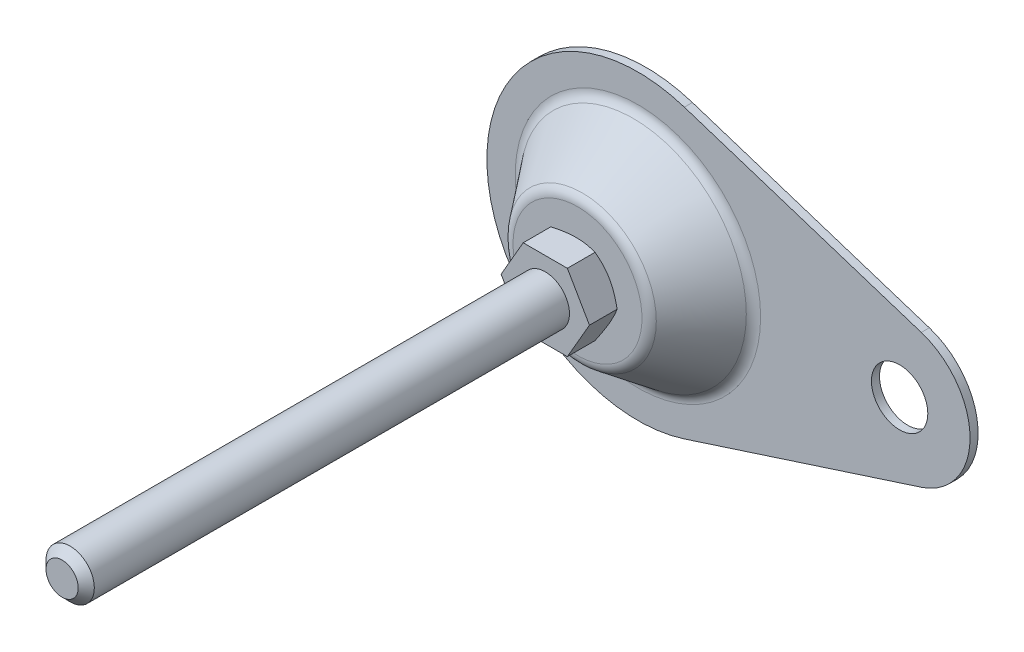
ISO-10303-21;
HEADER;
FILE_DESCRIPTION(('STEP AP214'),'2;1');
FILE_NAME('part.step','',(''),(''),'','','');
FILE_SCHEMA(('AUTOMOTIVE_DESIGN { 1 0 10303 214 1 1 1 1 }'));
ENDSEC;
DATA;
#1=APPLICATION_CONTEXT('core data for automotive mechanical design processes');
#2=APPLICATION_PROTOCOL_DEFINITION('international standard','automotive_design',2000,#1);
#3=PRODUCT_CONTEXT('',#1,'mechanical');
#4=PRODUCT('Part','Part','',(#3));
#5=PRODUCT_RELATED_PRODUCT_CATEGORY('part','',(#4));
#6=PRODUCT_DEFINITION_FORMATION('','',#4);
#7=PRODUCT_DEFINITION_CONTEXT('part definition',#1,'design');
#8=PRODUCT_DEFINITION('design','',#6,#7);
#9=PRODUCT_DEFINITION_SHAPE('','',#8);
#10=(LENGTH_UNIT() NAMED_UNIT(*) SI_UNIT(.MILLI.,.METRE.));
#11=(NAMED_UNIT(*) PLANE_ANGLE_UNIT() SI_UNIT($,.RADIAN.));
#12=(NAMED_UNIT(*) SI_UNIT($,.STERADIAN.) SOLID_ANGLE_UNIT());
#13=UNCERTAINTY_MEASURE_WITH_UNIT(LENGTH_MEASURE(1.E-05),#10,'distance_accuracy_value','');
#14=(GEOMETRIC_REPRESENTATION_CONTEXT(3) GLOBAL_UNCERTAINTY_ASSIGNED_CONTEXT((#13)) GLOBAL_UNIT_ASSIGNED_CONTEXT((#10,
#11,#12)) REPRESENTATION_CONTEXT('',''));
#15=CARTESIAN_POINT('',(0.,0.,0.));
#16=DIRECTION('',(0.,0.,1.));
#17=DIRECTION('',(1.,0.,0.));
#18=AXIS2_PLACEMENT_3D('',#15,#16,#17);
#19=CARTESIAN_POINT('',(65.,0.,2.));
#20=DIRECTION('',(0.,0.,1.));
#21=DIRECTION('',(1.,0.,0.));
#22=AXIS2_PLACEMENT_3D('',#19,#20,#21);
#23=PLANE('',#22);
#24=CARTESIAN_POINT('',(0.,0.,2.));
#25=DIRECTION('',(0.,0.,1.));
#26=DIRECTION('',(1.,0.,0.));
#27=AXIS2_PLACEMENT_3D('',#24,#25,#26);
#28=CIRCLE('',#27,30.4802116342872);
#29=CARTESIAN_POINT('',(30.4802116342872,0.,2.));
#30=VERTEX_POINT('',#29);
#31=EDGE_CURVE('E245',#30,#30,#28,.F.);
#32=ORIENTED_EDGE('',*,*,#31,.T.);
#33=EDGE_LOOP('',(#32));
#34=FACE_BOUND('',#33,.T.);
#35=CARTESIAN_POINT('',(65.,0.,2.));
#36=DIRECTION('',(0.,0.,1.));
#37=DIRECTION('',(1.,0.,0.));
#38=AXIS2_PLACEMENT_3D('',#35,#36,#37);
#39=CIRCLE('',#38,7.);
#40=CARTESIAN_POINT('',(72.,0.,2.));
#41=VERTEX_POINT('',#40);
#42=EDGE_CURVE('E262',#41,#41,#39,.T.);
#43=ORIENTED_EDGE('',*,*,#42,.F.);
#44=EDGE_LOOP('',(#43));
#45=FACE_BOUND('',#44,.T.);
#46=DIRECTION('',(-0.951485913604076,0.307692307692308,0.));
#47=VECTOR('',#46,1.);
#48=CARTESIAN_POINT('',(11.5384615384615,35.6807217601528,2.));
#49=LINE('',#48,#47);
#50=CARTESIAN_POINT('',(70.3846153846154,16.6510034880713,2.));
#51=VERTEX_POINT('',#50);
#52=CARTESIAN_POINT('',(11.5384615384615,35.6807217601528,2.));
#53=VERTEX_POINT('',#52);
#54=EDGE_CURVE('E112',#51,#53,#49,.T.);
#55=ORIENTED_EDGE('',*,*,#54,.T.);
#56=CARTESIAN_POINT('',(0.,0.,2.));
#57=DIRECTION('',(0.,0.,1.));
#58=DIRECTION('',(1.,0.,0.));
#59=AXIS2_PLACEMENT_3D('',#56,#57,#58);
#60=CIRCLE('',#59,37.5);
#61=CARTESIAN_POINT('',(11.5384615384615,-35.6807217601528,2.));
#62=VERTEX_POINT('',#61);
#63=EDGE_CURVE('E114',#53,#62,#60,.T.);
#64=ORIENTED_EDGE('',*,*,#63,.T.);
#65=DIRECTION('',(0.951485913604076,0.307692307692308,0.));
#66=VECTOR('',#65,1.);
#67=CARTESIAN_POINT('',(11.5384615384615,-35.6807217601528,2.));
#68=LINE('',#67,#66);
#69=CARTESIAN_POINT('',(70.3846153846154,-16.6510034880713,2.));
#70=VERTEX_POINT('',#69);
#71=EDGE_CURVE('E97',#62,#70,#68,.T.);
#72=ORIENTED_EDGE('',*,*,#71,.T.);
#73=CARTESIAN_POINT('',(65.,0.,2.));
#74=DIRECTION('',(0.,0.,1.));
#75=DIRECTION('',(1.,0.,0.));
#76=AXIS2_PLACEMENT_3D('',#73,#74,#75);
#77=CIRCLE('',#76,17.5);
#78=EDGE_CURVE('E106',#70,#51,#77,.T.);
#79=ORIENTED_EDGE('',*,*,#78,.T.);
#80=EDGE_LOOP('',(#55,#64,#72,#79));
#81=FACE_BOUND('',#80,.T.);
#82=ADVANCED_FACE('F14',(#34,#45,#81),#23,.T.);
#83=CARTESIAN_POINT('',(65.,0.,0.));
#84=DIRECTION('',(0.,0.,1.));
#85=DIRECTION('',(1.,0.,0.));
#86=AXIS2_PLACEMENT_3D('',#83,#84,#85);
#87=PLANE('',#86);
#88=CARTESIAN_POINT('',(65.,0.,0.));
#89=DIRECTION('',(0.,0.,1.));
#90=DIRECTION('',(1.,0.,0.));
#91=AXIS2_PLACEMENT_3D('',#88,#89,#90);
#92=CIRCLE('',#91,7.);
#93=CARTESIAN_POINT('',(72.,0.,0.));
#94=VERTEX_POINT('',#93);
#95=EDGE_CURVE('E258',#94,#94,#92,.T.);
#96=ORIENTED_EDGE('',*,*,#95,.T.);
#97=EDGE_LOOP('',(#96));
#98=FACE_BOUND('',#97,.T.);
#99=CARTESIAN_POINT('',(0.,0.,0.));
#100=DIRECTION('',(0.,0.,1.));
#101=DIRECTION('',(1.,0.,0.));
#102=AXIS2_PLACEMENT_3D('',#99,#100,#101);
#103=CIRCLE('',#102,37.5);
#104=CARTESIAN_POINT('',(11.5384615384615,35.6807217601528,0.));
#105=VERTEX_POINT('',#104);
#106=CARTESIAN_POINT('',(11.5384615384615,-35.6807217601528,0.));
#107=VERTEX_POINT('',#106);
#108=EDGE_CURVE('E275',#105,#107,#103,.T.);
#109=ORIENTED_EDGE('',*,*,#108,.F.);
#110=DIRECTION('',(-0.951485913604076,0.307692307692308,0.));
#111=VECTOR('',#110,1.);
#112=CARTESIAN_POINT('',(70.3846153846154,16.6510034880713,0.));
#113=LINE('',#112,#111);
#114=CARTESIAN_POINT('',(70.3846153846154,16.6510034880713,0.));
#115=VERTEX_POINT('',#114);
#116=EDGE_CURVE('E9',#115,#105,#113,.T.);
#117=ORIENTED_EDGE('',*,*,#116,.F.);
#118=CARTESIAN_POINT('',(65.,0.,0.));
#119=DIRECTION('',(0.,0.,1.));
#120=DIRECTION('',(1.,0.,0.));
#121=AXIS2_PLACEMENT_3D('',#118,#119,#120);
#122=CIRCLE('',#121,17.5);
#123=CARTESIAN_POINT('',(70.3846153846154,-16.6510034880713,0.));
#124=VERTEX_POINT('',#123);
#125=EDGE_CURVE('E22',#124,#115,#122,.T.);
#126=ORIENTED_EDGE('',*,*,#125,.F.);
#127=DIRECTION('',(0.951485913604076,0.307692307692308,0.));
#128=VECTOR('',#127,1.);
#129=CARTESIAN_POINT('',(70.3846153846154,-16.6510034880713,0.));
#130=LINE('',#129,#128);
#131=EDGE_CURVE('E99',#107,#124,#130,.T.);
#132=ORIENTED_EDGE('',*,*,#131,.F.);
#133=EDGE_LOOP('',(#109,#117,#126,#132));
#134=FACE_BOUND('',#133,.T.);
#135=ADVANCED_FACE('F215',(#98,#134),#87,.F.);
#136=CARTESIAN_POINT('',(0.,0.,17.));
#137=DIRECTION('',(0.,0.,-1.));
#138=DIRECTION('',(-1.,0.,0.));
#139=AXIS2_PLACEMENT_3D('',#136,#137,#138);
#140=PLANE('',#139);
#141=CARTESIAN_POINT('',(0.,0.,17.));
#142=DIRECTION('',(0.,0.,-1.));
#143=DIRECTION('',(-1.,0.,0.));
#144=AXIS2_PLACEMENT_3D('',#141,#142,#143);
#145=CIRCLE('',#144,16.0197883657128);
#146=CARTESIAN_POINT('',(-16.0197883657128,0.,17.));
#147=VERTEX_POINT('',#146);
#148=EDGE_CURVE('E278',#147,#147,#145,.F.);
#149=ORIENTED_EDGE('',*,*,#148,.T.);
#150=EDGE_LOOP('',(#149));
#151=FACE_BOUND('',#150,.T.);
#152=CARTESIAN_POINT('',(0.,0.,17.));
#153=DIRECTION('',(0.,0.,-1.));
#154=DIRECTION('',(-1.,0.,0.));
#155=AXIS2_PLACEMENT_3D('',#152,#153,#154);
#156=CIRCLE('',#155,9.);
#157=CARTESIAN_POINT('',(-9.,0.,17.));
#158=VERTEX_POINT('',#157);
#159=EDGE_CURVE('E122',#158,#158,#156,.T.);
#160=ORIENTED_EDGE('',*,*,#159,.T.);
#161=EDGE_LOOP('',(#160));
#162=FACE_BOUND('',#161,.T.);
#163=ADVANCED_FACE('F211',(#151,#162),#140,.F.);
#164=CARTESIAN_POINT('',(0.,0.,5.));
#165=DIRECTION('',(0.,0.,1.));
#166=DIRECTION('',(1.,0.,0.));
#167=AXIS2_PLACEMENT_3D('',#164,#165,#166);
#168=TOROIDAL_SURFACE('',#167,30.4802116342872,3.);
#169=CARTESIAN_POINT('',(0.,0.,3.1747053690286));
#170=DIRECTION('',(0.,0.,1.));
#171=DIRECTION('',(1.,0.,0.));
#172=AXIS2_PLACEMENT_3D('',#169,#170,#171);
#173=CIRCLE('',#172,28.0993925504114);
#174=CARTESIAN_POINT('',(28.0993925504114,0.,3.1747053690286));
#175=VERTEX_POINT('',#174);
#176=EDGE_CURVE('E242',#175,#175,#173,.T.);
#177=ORIENTED_EDGE('',*,*,#176,.F.);
#178=EDGE_LOOP('',(#177));
#179=FACE_BOUND('',#178,.T.);
#180=ORIENTED_EDGE('',*,*,#31,.F.);
#181=EDGE_LOOP('',(#180));
#182=FACE_BOUND('',#181,.T.);
#183=ADVANCED_FACE('F214',(#179,#182),#168,.F.);
#184=CARTESIAN_POINT('',(0.,0.,14.));
#185=DIRECTION('',(0.,0.,-1.));
#186=DIRECTION('',(-1.,0.,0.));
#187=AXIS2_PLACEMENT_3D('',#184,#185,#186);
#188=TOROIDAL_SURFACE('',#187,16.0197883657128,3.);
#189=ORIENTED_EDGE('',*,*,#148,.F.);
#190=EDGE_LOOP('',(#189));
#191=FACE_BOUND('',#190,.T.);
#192=CARTESIAN_POINT('',(0.,0.,15.8252946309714));
#193=DIRECTION('',(0.,0.,1.));
#194=DIRECTION('',(1.,0.,0.));
#195=AXIS2_PLACEMENT_3D('',#192,#193,#194);
#196=CIRCLE('',#195,18.4006074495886);
#197=CARTESIAN_POINT('',(18.4006074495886,0.,15.8252946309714));
#198=VERTEX_POINT('',#197);
#199=EDGE_CURVE('E251',#198,#198,#196,.F.);
#200=ORIENTED_EDGE('',*,*,#199,.F.);
#201=EDGE_LOOP('',(#200));
#202=FACE_BOUND('',#201,.T.);
#203=ADVANCED_FACE('F229',(#191,#202),#188,.T.);
#204=CARTESIAN_POINT('',(0.,0.,2.));
#205=DIRECTION('',(0.,0.,-1.));
#206=DIRECTION('',(-1.,0.,0.));
#207=AXIS2_PLACEMENT_3D('',#204,#205,#206);
#208=CYLINDRICAL_SURFACE('',#207,37.5);
#209=ORIENTED_EDGE('',*,*,#108,.T.);
#210=DIRECTION('',(0.,0.,1.));
#211=VECTOR('',#210,1.);
#212=CARTESIAN_POINT('',(11.5384615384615,-35.6807217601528,-8.));
#213=LINE('',#212,#211);
#214=EDGE_CURVE('E103',#107,#62,#213,.T.);
#215=ORIENTED_EDGE('',*,*,#214,.T.);
#216=ORIENTED_EDGE('',*,*,#63,.F.);
#217=DIRECTION('',(0.,0.,1.));
#218=VECTOR('',#217,1.);
#219=CARTESIAN_POINT('',(11.5384615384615,35.6807217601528,-8.));
#220=LINE('',#219,#218);
#221=EDGE_CURVE('E119',#105,#53,#220,.T.);
#222=ORIENTED_EDGE('',*,*,#221,.F.);
#223=EDGE_LOOP('',(#209,#215,#216,#222));
#224=FACE_BOUND('',#223,.T.);
#225=ADVANCED_FACE('F219',(#224),#208,.T.);
#226=CARTESIAN_POINT('',(65.,0.,2.));
#227=DIRECTION('',(0.,0.,-1.));
#228=DIRECTION('',(-1.,0.,0.));
#229=AXIS2_PLACEMENT_3D('',#226,#227,#228);
#230=CYLINDRICAL_SURFACE('',#229,7.);
#231=ORIENTED_EDGE('',*,*,#42,.T.);
#232=EDGE_LOOP('',(#231));
#233=FACE_BOUND('',#232,.T.);
#234=ORIENTED_EDGE('',*,*,#95,.F.);
#235=EDGE_LOOP('',(#234));
#236=FACE_BOUND('',#235,.T.);
#237=ADVANCED_FACE('F209',(#233,#236),#230,.F.);
#238=CARTESIAN_POINT('',(0.,0.,2.));
#239=DIRECTION('',(0.,0.,-1.));
#240=DIRECTION('',(-1.,0.,0.));
#241=AXIS2_PLACEMENT_3D('',#238,#239,#240);
#242=CONICAL_SURFACE('',#241,29.,0.654082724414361);
#243=ORIENTED_EDGE('',*,*,#176,.T.);
#244=EDGE_LOOP('',(#243));
#245=FACE_BOUND('',#244,.T.);
#246=ORIENTED_EDGE('',*,*,#199,.T.);
#247=EDGE_LOOP('',(#246));
#248=FACE_BOUND('',#247,.T.);
#249=ADVANCED_FACE('F151',(#245,#248),#242,.T.);
#250=CARTESIAN_POINT('',(0.,0.,17.));
#251=DIRECTION('',(0.,0.,1.));
#252=DIRECTION('',(1.,0.,0.));
#253=AXIS2_PLACEMENT_3D('',#250,#251,#252);
#254=CONICAL_SURFACE('',#253,9.,1.0471975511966);
#255=ORIENTED_EDGE('',*,*,#159,.F.);
#256=EDGE_LOOP('',(#255));
#257=FACE_BOUND('',#256,.T.);
#258=CARTESIAN_POINT('',(10.9697705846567,0.0002,18.137247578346));
#259=CARTESIAN_POINT('',(10.8492020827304,-0.208630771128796,18.0676485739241));
#260=CARTESIAN_POINT('',(10.7281840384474,-0.418240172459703,18.0012084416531));
#261=CARTESIAN_POINT('',(10.4851774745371,-0.839139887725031,17.8755224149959));
#262=CARTESIAN_POINT('',(10.3631886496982,-1.05043073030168,17.8162788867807));
#263=CARTESIAN_POINT('',(9.99525656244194,-1.68770779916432,17.6504897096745));
#264=CARTESIAN_POINT('',(9.74786083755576,-2.11620976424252,17.5561895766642));
#265=CARTESIAN_POINT('',(9.37764446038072,-2.75744333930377,17.4456138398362));
#266=CARTESIAN_POINT('',(9.2559298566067,-2.96825921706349,17.4141149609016));
#267=CARTESIAN_POINT('',(9.01193711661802,-3.39086703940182,17.3612933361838));
#268=CARTESIAN_POINT('',(8.88965896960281,-3.60265900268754,17.3399707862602));
#269=CARTESIAN_POINT('',(8.64489870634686,-4.02659621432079,17.3080481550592));
#270=CARTESIAN_POINT('',(8.52241700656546,-4.23874074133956,17.2974353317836));
#271=CARTESIAN_POINT('',(8.27734047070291,-4.66322575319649,17.2871576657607));
#272=CARTESIAN_POINT('',(8.15474563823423,-4.87556623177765,17.2874924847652));
#273=CARTESIAN_POINT('',(7.92555157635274,-5.27254199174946,17.2983485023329));
#274=CARTESIAN_POINT('',(7.81893617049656,-5.45720529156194,17.3075454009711));
#275=CARTESIAN_POINT('',(7.60595470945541,-5.82610000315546,17.3340405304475));
#276=CARTESIAN_POINT('',(7.49958867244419,-6.01033138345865,17.3513393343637));
#277=CARTESIAN_POINT('',(7.18090270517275,-6.56231167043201,17.414979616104));
#278=CARTESIAN_POINT('',(6.96914687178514,-6.92908353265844,17.4730570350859));
#279=CARTESIAN_POINT('',(6.5433889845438,-7.66651782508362,17.6182511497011));
#280=CARTESIAN_POINT('',(6.32944126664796,-8.03708614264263,17.7059833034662));
#281=CARTESIAN_POINT('',(5.90473630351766,-8.77269671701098,17.9050988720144));
#282=CARTESIAN_POINT('',(5.69397361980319,-9.137748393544,18.0164355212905));
#283=CARTESIAN_POINT('',(5.48471208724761,-9.5002,18.137247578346));
#284=B_SPLINE_CURVE_WITH_KNOTS('',3,(#258,#259,#260,#261,#262,#263,#264,#265,#266,#267,#268,
#269,#270,#271,#272,#273,#274,#275,#276,#277,#278,#279,#280,#281,#282,#283),.UNSPECIFIED.,.F.,
.F.,(4,2,2,2,2,2,2,2,2,2,2,2,4),(0.,0.752880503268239,1.50600787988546,3.01546870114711,
3.75167336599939,4.48789219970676,5.22323407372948,5.95855322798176,6.59868084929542,
7.23885375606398,8.52010929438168,9.82978009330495,11.1368800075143),.UNSPECIFIED.);
#285=CARTESIAN_POINT('',(10.9696551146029,0.,18.1371809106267));
#286=VERTEX_POINT('',#285);
#287=CARTESIAN_POINT('',(5.48482755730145,-9.5,18.1371809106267));
#288=VERTEX_POINT('',#287);
#289=EDGE_CURVE('E29',#286,#288,#284,.T.);
#290=ORIENTED_EDGE('',*,*,#289,.T.);
#291=CARTESIAN_POINT('',(-14.8064925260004,-9.5,21.9606551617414));
#292=CARTESIAN_POINT('',(-14.5986882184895,-9.5,21.8596787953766));
#293=CARTESIAN_POINT('',(-14.3906419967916,-9.5,21.759200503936));
#294=CARTESIAN_POINT('',(-13.9740152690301,-9.5,21.5593527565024));
#295=CARTESIAN_POINT('',(-13.7654347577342,-9.5,21.4599833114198));
#296=CARTESIAN_POINT('',(-13.1387615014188,-9.5,21.1636815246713));
#297=CARTESIAN_POINT('',(-12.7197974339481,-9.5,20.9685851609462));
#298=CARTESIAN_POINT('',(-11.876845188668,-9.5,20.5834203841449));
#299=CARTESIAN_POINT('',(-11.4528421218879,-9.5,20.3933844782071));
#300=CARTESIAN_POINT('',(-10.6014891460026,-9.5,20.0209911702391));
#301=CARTESIAN_POINT('',(-10.1741393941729,-9.5,19.8386334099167));
#302=CARTESIAN_POINT('',(-9.30148954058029,-9.5,19.4778705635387));
#303=CARTESIAN_POINT('',(-8.85605656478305,-9.5,19.2997851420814));
#304=CARTESIAN_POINT('',(-7.96000820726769,-9.5,18.9569149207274));
#305=CARTESIAN_POINT('',(-7.50939225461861,-9.5,18.7921316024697));
#306=CARTESIAN_POINT('',(-6.60307461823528,-9.5,18.4801372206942));
#307=CARTESIAN_POINT('',(-6.14738507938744,-9.5,18.3328912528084));
#308=CARTESIAN_POINT('',(-5.2294867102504,-9.5,18.0606451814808));
#309=CARTESIAN_POINT('',(-4.76727995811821,-9.5,17.9356381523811));
#310=CARTESIAN_POINT('',(-3.83850935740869,-9.5,17.714476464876));
#311=CARTESIAN_POINT('',(-3.37198330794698,-9.5,17.618167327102));
#312=CARTESIAN_POINT('',(-2.66788845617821,-9.5,17.4993766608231));
#313=CARTESIAN_POINT('',(-2.43245627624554,-9.5,17.4640570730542));
#314=CARTESIAN_POINT('',(-1.96039683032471,-9.5,17.4026664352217));
#315=CARTESIAN_POINT('',(-1.72376968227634,-9.5,17.3765944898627));
#316=CARTESIAN_POINT('',(-1.25276277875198,-9.5,17.3345496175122));
#317=CARTESIAN_POINT('',(-1.01839455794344,-9.5,17.3184479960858));
#318=CARTESIAN_POINT('',(-0.549187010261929,-9.5,17.2961739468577));
#319=CARTESIAN_POINT('',(-0.314347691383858,-9.5,17.2900013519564));
#320=CARTESIAN_POINT('',(0.155383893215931,-9.5,17.2877328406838));
#321=CARTESIAN_POINT('',(0.390276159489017,-9.5,17.2916370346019));
#322=CARTESIAN_POINT('',(0.859685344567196,-9.5,17.3094258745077));
#323=CARTESIAN_POINT('',(1.09420224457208,-9.5,17.3233110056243));
#324=CARTESIAN_POINT('',(1.65546939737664,-9.5,17.3681902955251));
#325=CARTESIAN_POINT('',(1.98185940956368,-9.5,17.403789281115));
#326=CARTESIAN_POINT('',(2.63225087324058,-9.5,17.4923957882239));
#327=CARTESIAN_POINT('',(2.95625200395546,-9.5,17.5454056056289));
#328=CARTESIAN_POINT('',(3.92427118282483,-9.5,17.7277430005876));
#329=CARTESIAN_POINT('',(4.56396460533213,-9.5,17.8803476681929));
#330=CARTESIAN_POINT('',(5.52083770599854,-9.5,18.1454776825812));
#331=CARTESIAN_POINT('',(5.84296313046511,-9.5,18.2411831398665));
#332=CARTESIAN_POINT('',(6.48408498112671,-9.5,18.4426495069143));
#333=CARTESIAN_POINT('',(6.803081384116,-9.5,18.5484104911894));
#334=CARTESIAN_POINT('',(7.43804722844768,-9.5,18.7682810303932));
#335=CARTESIAN_POINT('',(7.75401757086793,-9.5,18.8823880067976));
#336=CARTESIAN_POINT('',(8.3833286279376,-9.5,19.11759608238));
#337=CARTESIAN_POINT('',(8.69666939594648,-9.5,19.2386970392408));
#338=CARTESIAN_POINT('',(9.5211598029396,-9.5,19.5662339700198));
#339=CARTESIAN_POINT('',(10.0303459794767,-9.5,19.7776070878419));
#340=CARTESIAN_POINT('',(11.0436826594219,-9.5,20.2121380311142));
#341=CARTESIAN_POINT('',(11.5478326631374,-9.5,20.4352970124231));
#342=CARTESIAN_POINT('',(12.552217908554,-9.5,20.8906790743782));
#343=CARTESIAN_POINT('',(13.0524517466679,-9.5,21.1229052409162));
#344=CARTESIAN_POINT('',(14.0496005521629,-9.5,21.5943096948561));
#345=CARTESIAN_POINT('',(14.5465156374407,-9.5,21.8334877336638));
#346=CARTESIAN_POINT('',(15.5384000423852,-9.5,22.3176747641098));
#347=CARTESIAN_POINT('',(16.0333654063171,-9.5,22.5626918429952));
#348=CARTESIAN_POINT('',(17.0211046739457,-9.5,23.0571059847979));
#349=CARTESIAN_POINT('',(17.5138785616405,-9.5,23.3065030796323));
#350=CARTESIAN_POINT('',(18.497520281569,-9.5,23.8087855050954));
#351=CARTESIAN_POINT('',(18.9883884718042,-9.5,24.0616701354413));
#352=CARTESIAN_POINT('',(19.9686217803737,-9.5,24.5703375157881));
#353=CARTESIAN_POINT('',(20.4579868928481,-9.5,24.8261202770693));
#354=CARTESIAN_POINT('',(21.8249398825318,-9.5,25.5448554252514));
#355=CARTESIAN_POINT('',(22.7011299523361,-9.5,26.0104658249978));
#356=CARTESIAN_POINT('',(24.4505547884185,-9.5,26.9473081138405));
#357=CARTESIAN_POINT('',(25.3237893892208,-9.5,27.4185403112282));
#358=CARTESIAN_POINT('',(27.0652521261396,-9.5,28.3637393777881));
#359=CARTESIAN_POINT('',(27.9334873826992,-9.5,28.8376931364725));
#360=CARTESIAN_POINT('',(29.2344830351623,-9.5,29.5510225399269));
#361=CARTESIAN_POINT('',(29.6679066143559,-9.5,29.7891902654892));
#362=CARTESIAN_POINT('',(30.5343584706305,-9.5,30.2662424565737));
#363=CARTESIAN_POINT('',(30.967386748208,-9.5,30.5051269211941));
#364=CARTESIAN_POINT('',(31.4002412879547,-9.5,30.7443258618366));
#365=B_SPLINE_CURVE_WITH_KNOTS('',3,(#291,#292,#293,#294,#295,#296,#297,#298,#299,#300,#301,
#302,#303,#304,#305,#306,#307,#308,#309,#310,#311,#312,#313,#314,#315,#316,#317,#318,#319,#320,
#321,#322,#323,#324,#325,#326,#327,#328,#329,#330,#331,#332,#333,#334,#335,#336,#337,#338,#339,
#340,#341,#342,#343,#344,#345,#346,#347,#348,#349,#350,#351,#352,#353,#354,#355,#356,#357,#358,
#359,#360,#361,#362,#363,#364),.UNSPECIFIED.,.F.,.F.,(4,2,2,2,2,2,2,2,2,2,2,2,2,2,2,2,2,2,2,2,2,
2,2,2,2,2,2,2,2,2,2,2,2,2,2,2,4),(0.,0.693114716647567,1.38623624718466,2.77268086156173,
4.16654752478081,5.56034907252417,6.99932446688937,8.43845991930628,9.87468144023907,
11.310454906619,12.7383539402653,13.4524012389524,14.166379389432,14.8709383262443,
15.5754854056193,16.2800401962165,16.9846292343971,17.9690518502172,18.95360432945,
20.9237300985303,21.9317704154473,22.9398182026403,23.9475558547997,24.9552730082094,
26.6090019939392,28.2628934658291,29.9173528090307,31.5717530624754,33.2285958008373,
34.8854506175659,36.5419774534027,38.1985107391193,41.1751413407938,44.1519359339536,
47.119447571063,48.6030975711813,50.0867457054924),.UNSPECIFIED.);
#366=CARTESIAN_POINT('',(-5.48482755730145,-9.5,18.1371809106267));
#367=VERTEX_POINT('',#366);
#368=EDGE_CURVE('E158',#288,#367,#365,.F.);
#369=ORIENTED_EDGE('',*,*,#368,.T.);
#370=CARTESIAN_POINT('',(-5.48471208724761,-9.5002,18.137247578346));
#371=CARTESIAN_POINT('',(-5.6052805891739,-9.29136922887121,18.0676485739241));
#372=CARTESIAN_POINT('',(-5.72629863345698,-9.0817598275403,18.0012084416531));
#373=CARTESIAN_POINT('',(-5.96930519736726,-8.66086011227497,17.8755224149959));
#374=CARTESIAN_POINT('',(-6.09129402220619,-8.44956926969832,17.8162788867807));
#375=CARTESIAN_POINT('',(-6.4592261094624,-7.81229220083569,17.6504897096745));
#376=CARTESIAN_POINT('',(-6.70662183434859,-7.38379023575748,17.5561895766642));
#377=CARTESIAN_POINT('',(-7.07683821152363,-6.74255666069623,17.4456138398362));
#378=CARTESIAN_POINT('',(-7.19855281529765,-6.53174078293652,17.4141149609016));
#379=CARTESIAN_POINT('',(-7.44254555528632,-6.10913296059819,17.3612933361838));
#380=CARTESIAN_POINT('',(-7.56482370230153,-5.89734099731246,17.3399707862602));
#381=CARTESIAN_POINT('',(-7.80958396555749,-5.47340378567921,17.3080481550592));
#382=CARTESIAN_POINT('',(-7.93206566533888,-5.26125925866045,17.2974353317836));
#383=CARTESIAN_POINT('',(-8.17714220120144,-4.83677424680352,17.2871576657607));
#384=CARTESIAN_POINT('',(-8.29973703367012,-4.62443376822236,17.2874924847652));
#385=CARTESIAN_POINT('',(-8.52893109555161,-4.22745800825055,17.2983485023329));
#386=CARTESIAN_POINT('',(-8.63554650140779,-4.04279470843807,17.3075454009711));
#387=CARTESIAN_POINT('',(-8.84852796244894,-3.67389999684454,17.3340405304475));
#388=CARTESIAN_POINT('',(-8.95489399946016,-3.48966861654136,17.3513393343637));
#389=CARTESIAN_POINT('',(-9.27357996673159,-2.937688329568,17.414979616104));
#390=CARTESIAN_POINT('',(-9.48533580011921,-2.57091646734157,17.473057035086));
#391=CARTESIAN_POINT('',(-9.91109368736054,-1.83348217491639,17.6182511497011));
#392=CARTESIAN_POINT('',(-10.1250414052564,-1.46291385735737,17.7059833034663));
#393=CARTESIAN_POINT('',(-10.5497463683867,-0.727303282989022,17.9050988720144));
#394=CARTESIAN_POINT('',(-10.7605090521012,-0.362251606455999,18.0164355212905));
#395=CARTESIAN_POINT('',(-10.9697705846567,0.000199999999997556,18.137247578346));
#396=B_SPLINE_CURVE_WITH_KNOTS('',3,(#370,#371,#372,#373,#374,#375,#376,#377,#378,#379,#380,
#381,#382,#383,#384,#385,#386,#387,#388,#389,#390,#391,#392,#393,#394,#395),.UNSPECIFIED.,.F.,
.F.,(4,2,2,2,2,2,2,2,2,2,2,2,4),(0.,0.752880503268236,1.50600787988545,3.0154687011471,
3.75167336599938,4.48789219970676,5.22323407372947,5.95855322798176,6.59868084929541,
7.23885375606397,8.52010929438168,9.82978009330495,11.1368800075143),.UNSPECIFIED.);
#397=CARTESIAN_POINT('',(-10.9696551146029,0.,18.1371809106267));
#398=VERTEX_POINT('',#397);
#399=EDGE_CURVE('E127',#367,#398,#396,.T.);
#400=ORIENTED_EDGE('',*,*,#399,.T.);
#401=CARTESIAN_POINT('',(-10.9697705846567,-0.000200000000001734,18.137247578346));
#402=CARTESIAN_POINT('',(-10.8492020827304,0.208630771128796,18.0676485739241));
#403=CARTESIAN_POINT('',(-10.7281840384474,0.418240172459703,18.0012084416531));
#404=CARTESIAN_POINT('',(-10.4851774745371,0.83913988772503,17.8755224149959));
#405=CARTESIAN_POINT('',(-10.3631886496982,1.05043073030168,17.8162788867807));
#406=CARTESIAN_POINT('',(-9.99525656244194,1.68770779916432,17.6504897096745));
#407=CARTESIAN_POINT('',(-9.74786083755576,2.11620976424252,17.5561895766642));
#408=CARTESIAN_POINT('',(-9.37764446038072,2.75744333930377,17.4456138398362));
#409=CARTESIAN_POINT('',(-9.2559298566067,2.96825921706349,17.4141149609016));
#410=CARTESIAN_POINT('',(-9.01193711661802,3.39086703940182,17.3612933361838));
#411=CARTESIAN_POINT('',(-8.88965896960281,3.60265900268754,17.3399707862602));
#412=CARTESIAN_POINT('',(-8.64489870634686,4.02659621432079,17.3080481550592));
#413=CARTESIAN_POINT('',(-8.52241700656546,4.23874074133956,17.2974353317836));
#414=CARTESIAN_POINT('',(-8.27734047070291,4.66322575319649,17.2871576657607));
#415=CARTESIAN_POINT('',(-8.15474563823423,4.87556623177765,17.2874924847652));
#416=CARTESIAN_POINT('',(-7.92555157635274,5.27254199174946,17.2983485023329));
#417=CARTESIAN_POINT('',(-7.81893617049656,5.45720529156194,17.3075454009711));
#418=CARTESIAN_POINT('',(-7.60595470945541,5.82610000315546,17.3340405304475));
#419=CARTESIAN_POINT('',(-7.49958867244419,6.01033138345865,17.3513393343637));
#420=CARTESIAN_POINT('',(-7.18090270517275,6.56231167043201,17.414979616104));
#421=CARTESIAN_POINT('',(-6.96914687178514,6.92908353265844,17.4730570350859));
#422=CARTESIAN_POINT('',(-6.5433889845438,7.66651782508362,17.6182511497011));
#423=CARTESIAN_POINT('',(-6.32944126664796,8.03708614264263,17.7059833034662));
#424=CARTESIAN_POINT('',(-5.90473630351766,8.77269671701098,17.9050988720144));
#425=CARTESIAN_POINT('',(-5.69397361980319,9.13774839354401,18.0164355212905));
#426=CARTESIAN_POINT('',(-5.48471208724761,9.5002,18.137247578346));
#427=B_SPLINE_CURVE_WITH_KNOTS('',3,(#401,#402,#403,#404,#405,#406,#407,#408,#409,#410,#411,
#412,#413,#414,#415,#416,#417,#418,#419,#420,#421,#422,#423,#424,#425,#426),.UNSPECIFIED.,.F.,
.F.,(4,2,2,2,2,2,2,2,2,2,2,2,4),(0.,0.752880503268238,1.50600787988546,3.01546870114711,
3.75167336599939,4.48789219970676,5.22323407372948,5.95855322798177,6.59868084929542,
7.23885375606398,8.52010929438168,9.82978009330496,11.1368800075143),.UNSPECIFIED.);
#428=CARTESIAN_POINT('',(-5.48482755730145,9.5,18.1371809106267));
#429=VERTEX_POINT('',#428);
#430=EDGE_CURVE('E135',#398,#429,#427,.T.);
#431=ORIENTED_EDGE('',*,*,#430,.T.);
#432=CARTESIAN_POINT('',(-14.8064925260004,9.5,21.9606551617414));
#433=CARTESIAN_POINT('',(-14.5986882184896,9.5,21.8596787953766));
#434=CARTESIAN_POINT('',(-14.3906419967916,9.5,21.759200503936));
#435=CARTESIAN_POINT('',(-13.9740152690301,9.5,21.5593527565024));
#436=CARTESIAN_POINT('',(-13.7654347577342,9.5,21.4599833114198));
#437=CARTESIAN_POINT('',(-13.1387615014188,9.5,21.1636815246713));
#438=CARTESIAN_POINT('',(-12.7197974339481,9.5,20.9685851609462));
#439=CARTESIAN_POINT('',(-11.876845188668,9.5,20.5834203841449));
#440=CARTESIAN_POINT('',(-11.4528421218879,9.5,20.3933844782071));
#441=CARTESIAN_POINT('',(-10.6014891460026,9.5,20.0209911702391));
#442=CARTESIAN_POINT('',(-10.1741393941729,9.5,19.8386334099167));
#443=CARTESIAN_POINT('',(-9.3014895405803,9.5,19.4778705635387));
#444=CARTESIAN_POINT('',(-8.85605656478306,9.5,19.2997851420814));
#445=CARTESIAN_POINT('',(-7.9600082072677,9.5,18.9569149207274));
#446=CARTESIAN_POINT('',(-7.50939225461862,9.5,18.7921316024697));
#447=CARTESIAN_POINT('',(-6.60307461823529,9.5,18.4801372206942));
#448=CARTESIAN_POINT('',(-6.14738507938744,9.5,18.3328912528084));
#449=CARTESIAN_POINT('',(-5.2294867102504,9.5,18.0606451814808));
#450=CARTESIAN_POINT('',(-4.76727995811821,9.5,17.9356381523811));
#451=CARTESIAN_POINT('',(-3.83850935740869,9.5,17.714476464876));
#452=CARTESIAN_POINT('',(-3.37198330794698,9.5,17.618167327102));
#453=CARTESIAN_POINT('',(-2.66788845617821,9.5,17.4993766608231));
#454=CARTESIAN_POINT('',(-2.43245627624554,9.5,17.4640570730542));
#455=CARTESIAN_POINT('',(-1.96039683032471,9.5,17.4026664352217));
#456=CARTESIAN_POINT('',(-1.72376968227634,9.5,17.3765944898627));
#457=CARTESIAN_POINT('',(-1.25276277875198,9.5,17.3345496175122));
#458=CARTESIAN_POINT('',(-1.01839455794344,9.5,17.3184479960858));
#459=CARTESIAN_POINT('',(-0.549187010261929,9.5,17.2961739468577));
#460=CARTESIAN_POINT('',(-0.314347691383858,9.5,17.2900013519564));
#461=CARTESIAN_POINT('',(0.155383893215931,9.5,17.2877328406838));
#462=CARTESIAN_POINT('',(0.390276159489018,9.5,17.2916370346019));
#463=CARTESIAN_POINT('',(0.859685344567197,9.5,17.3094258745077));
#464=CARTESIAN_POINT('',(1.09420224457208,9.5,17.3233110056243));
#465=CARTESIAN_POINT('',(1.65546939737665,9.5,17.3681902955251));
#466=CARTESIAN_POINT('',(1.98185940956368,9.5,17.403789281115));
#467=CARTESIAN_POINT('',(2.63225087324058,9.5,17.4923957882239));
#468=CARTESIAN_POINT('',(2.95625200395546,9.5,17.5454056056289));
#469=CARTESIAN_POINT('',(3.92427118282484,9.5,17.7277430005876));
#470=CARTESIAN_POINT('',(4.56396460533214,9.5,17.8803476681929));
#471=CARTESIAN_POINT('',(5.52083770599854,9.5,18.1454776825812));
#472=CARTESIAN_POINT('',(5.84296313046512,9.5,18.2411831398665));
#473=CARTESIAN_POINT('',(6.48408498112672,9.5,18.4426495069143));
#474=CARTESIAN_POINT('',(6.80308138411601,9.5,18.5484104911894));
#475=CARTESIAN_POINT('',(7.43804722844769,9.5,18.7682810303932));
#476=CARTESIAN_POINT('',(7.75401757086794,9.5,18.8823880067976));
#477=CARTESIAN_POINT('',(8.3833286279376,9.5,19.11759608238));
#478=CARTESIAN_POINT('',(8.69666939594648,9.5,19.2386970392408));
#479=CARTESIAN_POINT('',(9.52115980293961,9.5,19.5662339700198));
#480=CARTESIAN_POINT('',(10.0303459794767,9.5,19.7776070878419));
#481=CARTESIAN_POINT('',(11.0436826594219,9.5,20.2121380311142));
#482=CARTESIAN_POINT('',(11.5478326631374,9.5,20.4352970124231));
#483=CARTESIAN_POINT('',(12.552217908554,9.5,20.8906790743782));
#484=CARTESIAN_POINT('',(13.0524517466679,9.5,21.1229052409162));
#485=CARTESIAN_POINT('',(14.0496005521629,9.5,21.5943096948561));
#486=CARTESIAN_POINT('',(14.5465156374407,9.5,21.8334877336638));
#487=CARTESIAN_POINT('',(15.5384000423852,9.5,22.3176747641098));
#488=CARTESIAN_POINT('',(16.0333654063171,9.5,22.5626918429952));
#489=CARTESIAN_POINT('',(17.0211046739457,9.5,23.0571059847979));
#490=CARTESIAN_POINT('',(17.5138785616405,9.5,23.3065030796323));
#491=CARTESIAN_POINT('',(18.497520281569,9.5,23.8087855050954));
#492=CARTESIAN_POINT('',(18.9883884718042,9.5,24.0616701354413));
#493=CARTESIAN_POINT('',(19.9686217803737,9.5,24.5703375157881));
#494=CARTESIAN_POINT('',(20.4579868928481,9.5,24.8261202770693));
#495=CARTESIAN_POINT('',(21.8249398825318,9.5,25.5448554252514));
#496=CARTESIAN_POINT('',(22.7011299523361,9.5,26.0104658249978));
#497=CARTESIAN_POINT('',(24.4505547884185,9.5,26.9473081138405));
#498=CARTESIAN_POINT('',(25.3237893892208,9.5,27.4185403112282));
#499=CARTESIAN_POINT('',(27.0652521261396,9.5,28.3637393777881));
#500=CARTESIAN_POINT('',(27.9334873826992,9.5,28.8376931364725));
#501=CARTESIAN_POINT('',(29.2344830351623,9.5,29.5510225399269));
#502=CARTESIAN_POINT('',(29.6679066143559,9.5,29.7891902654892));
#503=CARTESIAN_POINT('',(30.5343584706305,9.5,30.2662424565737));
#504=CARTESIAN_POINT('',(30.967386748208,9.5,30.5051269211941));
#505=CARTESIAN_POINT('',(31.4002412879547,9.5,30.7443258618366));
#506=B_SPLINE_CURVE_WITH_KNOTS('',3,(#432,#433,#434,#435,#436,#437,#438,#439,#440,#441,#442,
#443,#444,#445,#446,#447,#448,#449,#450,#451,#452,#453,#454,#455,#456,#457,#458,#459,#460,#461,
#462,#463,#464,#465,#466,#467,#468,#469,#470,#471,#472,#473,#474,#475,#476,#477,#478,#479,#480,
#481,#482,#483,#484,#485,#486,#487,#488,#489,#490,#491,#492,#493,#494,#495,#496,#497,#498,#499,
#500,#501,#502,#503,#504,#505),.UNSPECIFIED.,.F.,.F.,(4,2,2,2,2,2,2,2,2,2,2,2,2,2,2,2,2,2,2,2,2,
2,2,2,2,2,2,2,2,2,2,2,2,2,2,2,4),(0.,0.693114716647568,1.38623624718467,2.77268086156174,
4.16654752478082,5.56034907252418,6.99932446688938,8.43845991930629,9.87468144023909,
11.3104549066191,12.7383539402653,13.4524012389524,14.166379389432,14.8709383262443,
15.5754854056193,16.2800401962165,16.9846292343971,17.9690518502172,18.95360432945,
20.9237300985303,21.9317704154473,22.9398182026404,23.9475558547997,24.9552730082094,
26.6090019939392,28.2628934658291,29.9173528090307,31.5717530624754,33.2285958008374,
34.8854506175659,36.5419774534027,38.1985107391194,41.1751413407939,44.1519359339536,
47.1194475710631,48.6030975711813,50.0867457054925),.UNSPECIFIED.);
#507=CARTESIAN_POINT('',(5.48482755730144,9.5,18.1371809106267));
#508=VERTEX_POINT('',#507);
#509=EDGE_CURVE('E169',#429,#508,#506,.T.);
#510=ORIENTED_EDGE('',*,*,#509,.T.);
#511=CARTESIAN_POINT('',(5.48471208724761,9.5002,18.137247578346));
#512=CARTESIAN_POINT('',(5.6052805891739,9.29136922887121,18.0676485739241));
#513=CARTESIAN_POINT('',(5.72629863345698,9.0817598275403,18.0012084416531));
#514=CARTESIAN_POINT('',(5.96930519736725,8.66086011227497,17.8755224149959));
#515=CARTESIAN_POINT('',(6.09129402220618,8.44956926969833,17.8162788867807));
#516=CARTESIAN_POINT('',(6.4592261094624,7.81229220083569,17.6504897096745));
#517=CARTESIAN_POINT('',(6.70662183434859,7.38379023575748,17.5561895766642));
#518=CARTESIAN_POINT('',(7.07683821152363,6.74255666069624,17.4456138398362));
#519=CARTESIAN_POINT('',(7.19855281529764,6.53174078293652,17.4141149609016));
#520=CARTESIAN_POINT('',(7.44254555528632,6.10913296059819,17.3612933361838));
#521=CARTESIAN_POINT('',(7.56482370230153,5.89734099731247,17.3399707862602));
#522=CARTESIAN_POINT('',(7.80958396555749,5.47340378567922,17.3080481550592));
#523=CARTESIAN_POINT('',(7.93206566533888,5.26125925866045,17.2974353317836));
#524=CARTESIAN_POINT('',(8.17714220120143,4.83677424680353,17.2871576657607));
#525=CARTESIAN_POINT('',(8.29973703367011,4.62443376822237,17.2874924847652));
#526=CARTESIAN_POINT('',(8.5289310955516,4.22745800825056,17.2983485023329));
#527=CARTESIAN_POINT('',(8.63554650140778,4.04279470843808,17.3075454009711));
#528=CARTESIAN_POINT('',(8.84852796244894,3.67389999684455,17.3340405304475));
#529=CARTESIAN_POINT('',(8.95489399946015,3.48966861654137,17.3513393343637));
#530=CARTESIAN_POINT('',(9.27357996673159,2.93768832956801,17.414979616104));
#531=CARTESIAN_POINT('',(9.4853358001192,2.57091646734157,17.473057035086));
#532=CARTESIAN_POINT('',(9.91109368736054,1.83348217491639,17.6182511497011));
#533=CARTESIAN_POINT('',(10.1250414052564,1.46291385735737,17.7059833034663));
#534=CARTESIAN_POINT('',(10.5497463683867,0.72730328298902,17.9050988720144));
#535=CARTESIAN_POINT('',(10.7605090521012,0.362251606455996,18.0164355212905));
#536=CARTESIAN_POINT('',(10.9697705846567,-0.000200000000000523,18.137247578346));
#537=B_SPLINE_CURVE_WITH_KNOTS('',3,(#511,#512,#513,#514,#515,#516,#517,#518,#519,#520,#521,
#522,#523,#524,#525,#526,#527,#528,#529,#530,#531,#532,#533,#534,#535,#536),.UNSPECIFIED.,.F.,
.F.,(4,2,2,2,2,2,2,2,2,2,2,2,4),(0.,0.752880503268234,1.50600787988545,3.0154687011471,
3.75167336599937,4.48789219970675,5.22323407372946,5.95855322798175,6.5986808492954,
7.23885375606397,8.52010929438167,9.82978009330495,11.1368800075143),.UNSPECIFIED.);
#538=EDGE_CURVE('E176',#508,#286,#537,.T.);
#539=ORIENTED_EDGE('',*,*,#538,.T.);
#540=EDGE_LOOP('',(#290,#369,#400,#431,#510,#539));
#541=FACE_BOUND('',#540,.T.);
#542=ADVANCED_FACE('F145',(#257,#541),#254,.T.);
#543=CARTESIAN_POINT('',(0.,0.,145.));
#544=DIRECTION('',(0.,0.,1.));
#545=DIRECTION('',(1.,0.,0.));
#546=AXIS2_PLACEMENT_3D('',#543,#544,#545);
#547=PLANE('',#546);
#548=CARTESIAN_POINT('',(0.,0.,145.));
#549=DIRECTION('',(0.,0.,1.));
#550=DIRECTION('',(1.,0.,0.));
#551=AXIS2_PLACEMENT_3D('',#548,#549,#550);
#552=CIRCLE('',#551,4.);
#553=CARTESIAN_POINT('',(4.,0.,145.));
#554=VERTEX_POINT('',#553);
#555=EDGE_CURVE('E246',#554,#554,#552,.T.);
#556=ORIENTED_EDGE('',*,*,#555,.T.);
#557=EDGE_LOOP('',(#556));
#558=FACE_BOUND('',#557,.T.);
#559=ADVANCED_FACE('F150',(#558),#547,.T.);
#560=CARTESIAN_POINT('',(0.,0.,145.));
#561=DIRECTION('',(0.,0.,-1.));
#562=DIRECTION('',(-1.,0.,0.));
#563=AXIS2_PLACEMENT_3D('',#560,#561,#562);
#564=CONICAL_SURFACE('',#563,4.,0.785398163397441);
#565=CARTESIAN_POINT('',(0.,0.,143.));
#566=DIRECTION('',(0.,0.,1.));
#567=DIRECTION('',(1.,0.,0.));
#568=AXIS2_PLACEMENT_3D('',#565,#566,#567);
#569=CIRCLE('',#568,6.);
#570=CARTESIAN_POINT('',(6.,0.,143.));
#571=VERTEX_POINT('',#570);
#572=EDGE_CURVE('E249',#571,#571,#569,.F.);
#573=ORIENTED_EDGE('',*,*,#572,.F.);
#574=EDGE_LOOP('',(#573));
#575=FACE_BOUND('',#574,.T.);
#576=ORIENTED_EDGE('',*,*,#555,.F.);
#577=EDGE_LOOP('',(#576));
#578=FACE_BOUND('',#577,.T.);
#579=ADVANCED_FACE('F16',(#575,#578),#564,.T.);
#580=CARTESIAN_POINT('',(0.,0.,145.));
#581=DIRECTION('',(0.,0.,-1.));
#582=DIRECTION('',(-1.,0.,0.));
#583=AXIS2_PLACEMENT_3D('',#580,#581,#582);
#584=CYLINDRICAL_SURFACE('',#583,6.);
#585=CARTESIAN_POINT('',(0.,0.,25.));
#586=DIRECTION('',(0.,0.,1.));
#587=DIRECTION('',(1.,0.,0.));
#588=AXIS2_PLACEMENT_3D('',#585,#586,#587);
#589=CIRCLE('',#588,6.);
#590=CARTESIAN_POINT('',(6.,0.,25.));
#591=VERTEX_POINT('',#590);
#592=EDGE_CURVE('E256',#591,#591,#589,.T.);
#593=ORIENTED_EDGE('',*,*,#592,.T.);
#594=EDGE_LOOP('',(#593));
#595=FACE_BOUND('',#594,.T.);
#596=ORIENTED_EDGE('',*,*,#572,.T.);
#597=EDGE_LOOP('',(#596));
#598=FACE_BOUND('',#597,.T.);
#599=ADVANCED_FACE('F203',(#595,#598),#584,.T.);
#600=CARTESIAN_POINT('',(0.,0.,25.));
#601=DIRECTION('',(0.,0.,1.));
#602=DIRECTION('',(1.,0.,0.));
#603=AXIS2_PLACEMENT_3D('',#600,#601,#602);
#604=PLANE('',#603);
#605=DIRECTION('',(0.5,0.866025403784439,0.));
#606=VECTOR('',#605,1.);
#607=CARTESIAN_POINT('',(5.48482755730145,-9.5,25.));
#608=LINE('',#607,#606);
#609=CARTESIAN_POINT('',(5.48482755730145,-9.5,25.));
#610=VERTEX_POINT('',#609);
#611=CARTESIAN_POINT('',(10.9696551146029,0.,25.));
#612=VERTEX_POINT('',#611);
#613=EDGE_CURVE('E321',#610,#612,#608,.T.);
#614=ORIENTED_EDGE('',*,*,#613,.T.);
#615=DIRECTION('',(-0.5,0.866025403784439,0.));
#616=VECTOR('',#615,1.);
#617=CARTESIAN_POINT('',(10.9696551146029,0.,25.));
#618=LINE('',#617,#616);
#619=CARTESIAN_POINT('',(5.48482755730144,9.5,25.));
#620=VERTEX_POINT('',#619);
#621=EDGE_CURVE('E320',#612,#620,#618,.T.);
#622=ORIENTED_EDGE('',*,*,#621,.T.);
#623=DIRECTION('',(-1.,0.,0.));
#624=VECTOR('',#623,1.);
#625=CARTESIAN_POINT('',(5.48482755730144,9.5,25.));
#626=LINE('',#625,#624);
#627=CARTESIAN_POINT('',(-5.48482755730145,9.5,25.));
#628=VERTEX_POINT('',#627);
#629=EDGE_CURVE('E318',#620,#628,#626,.T.);
#630=ORIENTED_EDGE('',*,*,#629,.T.);
#631=DIRECTION('',(-0.5,-0.866025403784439,0.));
#632=VECTOR('',#631,1.);
#633=CARTESIAN_POINT('',(-5.48482755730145,9.5,25.));
#634=LINE('',#633,#632);
#635=CARTESIAN_POINT('',(-10.9696551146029,0.,25.));
#636=VERTEX_POINT('',#635);
#637=EDGE_CURVE('E314',#628,#636,#634,.T.);
#638=ORIENTED_EDGE('',*,*,#637,.T.);
#639=DIRECTION('',(0.5,-0.866025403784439,0.));
#640=VECTOR('',#639,1.);
#641=CARTESIAN_POINT('',(-10.9696551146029,0.,25.));
#642=LINE('',#641,#640);
#643=CARTESIAN_POINT('',(-5.48482755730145,-9.5,25.));
#644=VERTEX_POINT('',#643);
#645=EDGE_CURVE('E328',#636,#644,#642,.T.);
#646=ORIENTED_EDGE('',*,*,#645,.T.);
#647=DIRECTION('',(1.,0.,0.));
#648=VECTOR('',#647,1.);
#649=CARTESIAN_POINT('',(-5.48482755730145,-9.5,25.));
#650=LINE('',#649,#648);
#651=EDGE_CURVE('E37',#644,#610,#650,.T.);
#652=ORIENTED_EDGE('',*,*,#651,.T.);
#653=EDGE_LOOP('',(#614,#622,#630,#638,#646,#652));
#654=FACE_BOUND('',#653,.T.);
#655=ORIENTED_EDGE('',*,*,#592,.F.);
#656=EDGE_LOOP('',(#655));
#657=FACE_BOUND('',#656,.T.);
#658=ADVANCED_FACE('F154',(#654,#657),#604,.T.);
#659=CARTESIAN_POINT('',(-5.48482755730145,-9.5,25.));
#660=DIRECTION('',(0.,1.,0.));
#661=DIRECTION('',(0.,0.,1.));
#662=AXIS2_PLACEMENT_3D('',#659,#660,#661);
#663=PLANE('',#662);
#664=ORIENTED_EDGE('',*,*,#368,.F.);
#665=DIRECTION('',(0.,0.,-1.));
#666=VECTOR('',#665,1.);
#667=CARTESIAN_POINT('',(5.48482755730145,-9.5,25.));
#668=LINE('',#667,#666);
#669=EDGE_CURVE('E304',#610,#288,#668,.T.);
#670=ORIENTED_EDGE('',*,*,#669,.F.);
#671=ORIENTED_EDGE('',*,*,#651,.F.);
#672=DIRECTION('',(0.,0.,-1.));
#673=VECTOR('',#672,1.);
#674=CARTESIAN_POINT('',(-5.48482755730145,-9.5,25.));
#675=LINE('',#674,#673);
#676=EDGE_CURVE('E300',#644,#367,#675,.T.);
#677=ORIENTED_EDGE('',*,*,#676,.T.);
#678=EDGE_LOOP('',(#664,#670,#671,#677));
#679=FACE_BOUND('',#678,.T.);
#680=ADVANCED_FACE('F303',(#679),#663,.F.);
#681=CARTESIAN_POINT('',(-10.9696551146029,0.,25.));
#682=DIRECTION('',(0.866025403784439,0.5,0.));
#683=DIRECTION('',(-0.5,0.866025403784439,0.));
#684=AXIS2_PLACEMENT_3D('',#681,#682,#683);
#685=PLANE('',#684);
#686=ORIENTED_EDGE('',*,*,#399,.F.);
#687=ORIENTED_EDGE('',*,*,#676,.F.);
#688=ORIENTED_EDGE('',*,*,#645,.F.);
#689=DIRECTION('',(0.,0.,-1.));
#690=VECTOR('',#689,1.);
#691=CARTESIAN_POINT('',(-10.9696551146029,0.,25.));
#692=LINE('',#691,#690);
#693=EDGE_CURVE('E302',#636,#398,#692,.T.);
#694=ORIENTED_EDGE('',*,*,#693,.T.);
#695=EDGE_LOOP('',(#686,#687,#688,#694));
#696=FACE_BOUND('',#695,.T.);
#697=ADVANCED_FACE('F142',(#696),#685,.F.);
#698=CARTESIAN_POINT('',(-5.48482755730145,9.5,25.));
#699=DIRECTION('',(0.866025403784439,-0.5,0.));
#700=DIRECTION('',(0.5,0.866025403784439,0.));
#701=AXIS2_PLACEMENT_3D('',#698,#699,#700);
#702=PLANE('',#701);
#703=ORIENTED_EDGE('',*,*,#430,.F.);
#704=ORIENTED_EDGE('',*,*,#693,.F.);
#705=ORIENTED_EDGE('',*,*,#637,.F.);
#706=DIRECTION('',(0.,0.,-1.));
#707=VECTOR('',#706,1.);
#708=CARTESIAN_POINT('',(-5.48482755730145,9.5,25.));
#709=LINE('',#708,#707);
#710=EDGE_CURVE('E270',#628,#429,#709,.T.);
#711=ORIENTED_EDGE('',*,*,#710,.T.);
#712=EDGE_LOOP('',(#703,#704,#705,#711));
#713=FACE_BOUND('',#712,.T.);
#714=ADVANCED_FACE('F313',(#713),#702,.F.);
#715=CARTESIAN_POINT('',(5.48482755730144,9.5,25.));
#716=DIRECTION('',(0.,-1.,0.));
#717=DIRECTION('',(1.,0.,0.));
#718=AXIS2_PLACEMENT_3D('',#715,#716,#717);
#719=PLANE('',#718);
#720=ORIENTED_EDGE('',*,*,#509,.F.);
#721=ORIENTED_EDGE('',*,*,#710,.F.);
#722=ORIENTED_EDGE('',*,*,#629,.F.);
#723=DIRECTION('',(0.,0.,-1.));
#724=VECTOR('',#723,1.);
#725=CARTESIAN_POINT('',(5.48482755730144,9.5,25.));
#726=LINE('',#725,#724);
#727=EDGE_CURVE('E265',#620,#508,#726,.T.);
#728=ORIENTED_EDGE('',*,*,#727,.T.);
#729=EDGE_LOOP('',(#720,#721,#722,#728));
#730=FACE_BOUND('',#729,.T.);
#731=ADVANCED_FACE('F192',(#730),#719,.F.);
#732=CARTESIAN_POINT('',(10.9696551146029,0.,25.));
#733=DIRECTION('',(-0.866025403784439,-0.5,0.));
#734=DIRECTION('',(0.5,-0.866025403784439,0.));
#735=AXIS2_PLACEMENT_3D('',#732,#733,#734);
#736=PLANE('',#735);
#737=ORIENTED_EDGE('',*,*,#538,.F.);
#738=ORIENTED_EDGE('',*,*,#727,.F.);
#739=ORIENTED_EDGE('',*,*,#621,.F.);
#740=DIRECTION('',(0.,0.,-1.));
#741=VECTOR('',#740,1.);
#742=CARTESIAN_POINT('',(10.9696551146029,0.,25.));
#743=LINE('',#742,#741);
#744=EDGE_CURVE('E259',#612,#286,#743,.T.);
#745=ORIENTED_EDGE('',*,*,#744,.T.);
#746=EDGE_LOOP('',(#737,#738,#739,#745));
#747=FACE_BOUND('',#746,.T.);
#748=ADVANCED_FACE('F188',(#747),#736,.F.);
#749=CARTESIAN_POINT('',(5.48482755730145,-9.5,25.));
#750=DIRECTION('',(-0.866025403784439,0.5,0.));
#751=DIRECTION('',(-0.5,-0.866025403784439,0.));
#752=AXIS2_PLACEMENT_3D('',#749,#750,#751);
#753=PLANE('',#752);
#754=ORIENTED_EDGE('',*,*,#289,.F.);
#755=ORIENTED_EDGE('',*,*,#744,.F.);
#756=ORIENTED_EDGE('',*,*,#613,.F.);
#757=ORIENTED_EDGE('',*,*,#669,.T.);
#758=EDGE_LOOP('',(#754,#755,#756,#757));
#759=FACE_BOUND('',#758,.T.);
#760=ADVANCED_FACE('F191',(#759),#753,.F.);
#761=CARTESIAN_POINT('',(11.5384615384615,35.6807217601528,-8.));
#762=DIRECTION('',(0.307692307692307,0.951485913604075,0.));
#763=DIRECTION('',(-0.951485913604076,0.307692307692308,0.));
#764=AXIS2_PLACEMENT_3D('',#761,#762,#763);
#765=PLANE('',#764);
#766=ORIENTED_EDGE('',*,*,#116,.T.);
#767=ORIENTED_EDGE('',*,*,#221,.T.);
#768=ORIENTED_EDGE('',*,*,#54,.F.);
#769=DIRECTION('',(0.,0.,1.));
#770=VECTOR('',#769,1.);
#771=CARTESIAN_POINT('',(70.3846153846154,16.6510034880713,-8.));
#772=LINE('',#771,#770);
#773=EDGE_CURVE('E102',#115,#51,#772,.T.);
#774=ORIENTED_EDGE('',*,*,#773,.F.);
#775=EDGE_LOOP('',(#766,#767,#768,#774));
#776=FACE_BOUND('',#775,.T.);
#777=ADVANCED_FACE('F198',(#776),#765,.T.);
#778=CARTESIAN_POINT('',(65.,0.,-8.));
#779=DIRECTION('',(0.,0.,1.));
#780=DIRECTION('',(1.,0.,0.));
#781=AXIS2_PLACEMENT_3D('',#778,#779,#780);
#782=CYLINDRICAL_SURFACE('',#781,17.5);
#783=ORIENTED_EDGE('',*,*,#125,.T.);
#784=ORIENTED_EDGE('',*,*,#773,.T.);
#785=ORIENTED_EDGE('',*,*,#78,.F.);
#786=DIRECTION('',(0.,0.,1.));
#787=VECTOR('',#786,1.);
#788=CARTESIAN_POINT('',(70.3846153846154,-16.6510034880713,-8.));
#789=LINE('',#788,#787);
#790=EDGE_CURVE('E92',#124,#70,#789,.T.);
#791=ORIENTED_EDGE('',*,*,#790,.F.);
#792=EDGE_LOOP('',(#783,#784,#785,#791));
#793=FACE_BOUND('',#792,.T.);
#794=ADVANCED_FACE('F107',(#793),#782,.T.);
#795=CARTESIAN_POINT('',(11.5384615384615,-35.6807217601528,-8.));
#796=DIRECTION('',(0.307692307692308,-0.951485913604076,0.));
#797=DIRECTION('',(0.951485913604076,0.307692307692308,0.));
#798=AXIS2_PLACEMENT_3D('',#795,#796,#797);
#799=PLANE('',#798);
#800=ORIENTED_EDGE('',*,*,#131,.T.);
#801=ORIENTED_EDGE('',*,*,#790,.T.);
#802=ORIENTED_EDGE('',*,*,#71,.F.);
#803=ORIENTED_EDGE('',*,*,#214,.F.);
#804=EDGE_LOOP('',(#800,#801,#802,#803));
#805=FACE_BOUND('',#804,.T.);
#806=ADVANCED_FACE('F94',(#805),#799,.T.);
#807=CLOSED_SHELL('',(#82,#135,#163,#183,#203,#225,#237,#249,#542,#559,#579,#599,#658,#680,#697,
#714,#731,#748,#760,#777,#794,#806));
#808=MANIFOLD_SOLID_BREP('B1',#807);
#809=ADVANCED_BREP_SHAPE_REPRESENTATION('',(#18,#808),#14);
#810=SHAPE_DEFINITION_REPRESENTATION(#9,#809);
ENDSEC;
END-ISO-10303-21;
